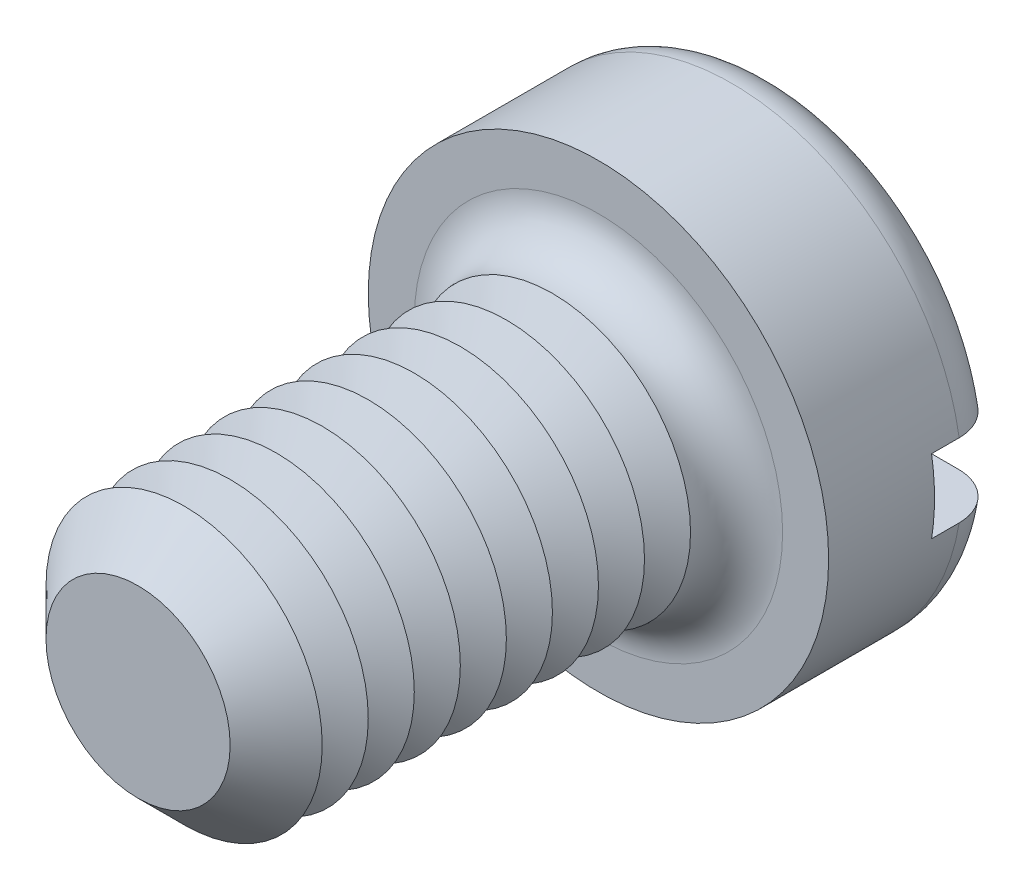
ISO-10303-21;
HEADER;
FILE_DESCRIPTION(('STEP AP214'),'2;1');
FILE_NAME('part.step','',(''),(''),'','','');
FILE_SCHEMA(('AUTOMOTIVE_DESIGN { 1 0 10303 214 1 1 1 1 }'));
ENDSEC;
DATA;
#1=APPLICATION_CONTEXT('core data for automotive mechanical design processes');
#2=APPLICATION_PROTOCOL_DEFINITION('international standard','automotive_design',2000,#1);
#3=PRODUCT_CONTEXT('',#1,'mechanical');
#4=PRODUCT('Part','Part','',(#3));
#5=PRODUCT_RELATED_PRODUCT_CATEGORY('part','',(#4));
#6=PRODUCT_DEFINITION_FORMATION('','',#4);
#7=PRODUCT_DEFINITION_CONTEXT('part definition',#1,'design');
#8=PRODUCT_DEFINITION('design','',#6,#7);
#9=PRODUCT_DEFINITION_SHAPE('','',#8);
#10=(LENGTH_UNIT() NAMED_UNIT(*) SI_UNIT(.MILLI.,.METRE.));
#11=(NAMED_UNIT(*) PLANE_ANGLE_UNIT() SI_UNIT($,.RADIAN.));
#12=(NAMED_UNIT(*) SI_UNIT($,.STERADIAN.) SOLID_ANGLE_UNIT());
#13=UNCERTAINTY_MEASURE_WITH_UNIT(LENGTH_MEASURE(1.E-05),#10,'distance_accuracy_value','');
#14=(GEOMETRIC_REPRESENTATION_CONTEXT(3) GLOBAL_UNCERTAINTY_ASSIGNED_CONTEXT((#13)) GLOBAL_UNIT_ASSIGNED_CONTEXT((#10,
#11,#12)) REPRESENTATION_CONTEXT('',''));
#15=CARTESIAN_POINT('',(0.,0.,0.));
#16=DIRECTION('',(0.,0.,1.));
#17=DIRECTION('',(1.,0.,0.));
#18=AXIS2_PLACEMENT_3D('',#15,#16,#17);
#19=CARTESIAN_POINT('',(0.,0.,-3.9));
#20=DIRECTION('',(0.,0.,1.));
#21=DIRECTION('',(1.,0.,0.));
#22=AXIS2_PLACEMENT_3D('',#19,#20,#21);
#23=PLANE('',#22);
#24=CARTESIAN_POINT('',(0.,0.,-3.9));
#25=DIRECTION('',(0.,0.,1.));
#26=DIRECTION('',(1.,0.,0.));
#27=AXIS2_PLACEMENT_3D('',#24,#25,#26);
#28=CIRCLE('',#27,4.);
#29=CARTESIAN_POINT('',(-3.91918358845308,0.800000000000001,-3.9));
#30=VERTEX_POINT('',#29);
#31=CARTESIAN_POINT('',(3.91918358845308,0.8,-3.9));
#32=VERTEX_POINT('',#31);
#33=EDGE_CURVE('E116',#30,#32,#28,.F.);
#34=ORIENTED_EDGE('',*,*,#33,.T.);
#35=DIRECTION('',(1.,0.,0.));
#36=VECTOR('',#35,1.);
#37=CARTESIAN_POINT('',(-5.,0.800000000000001,-3.9));
#38=LINE('',#37,#36);
#39=EDGE_CURVE('E111',#30,#32,#38,.T.);
#40=ORIENTED_EDGE('',*,*,#39,.F.);
#41=EDGE_LOOP('',(#34,#40));
#42=FACE_BOUND('',#41,.T.);
#43=ADVANCED_FACE('F39',(#42),#23,.F.);
#44=CARTESIAN_POINT('',(0.,0.,-2.9));
#45=DIRECTION('',(0.,0.,1.));
#46=DIRECTION('',(1.,0.,0.));
#47=AXIS2_PLACEMENT_3D('',#44,#45,#46);
#48=TOROIDAL_SURFACE('',#47,4.,1.);
#49=CARTESIAN_POINT('',(-4.76648512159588,0.800000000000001,-3.45304061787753));
#50=CARTESIAN_POINT('',(-4.73486405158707,0.800000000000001,-3.50001565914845));
#51=CARTESIAN_POINT('',(-4.69920787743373,0.800000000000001,-3.54432871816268));
#52=CARTESIAN_POINT('',(-4.62090302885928,0.800000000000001,-3.62634638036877));
#53=CARTESIAN_POINT('',(-4.57824494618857,0.800000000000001,-3.66404194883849));
#54=CARTESIAN_POINT('',(-4.48726975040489,0.800000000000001,-3.73172278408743));
#55=CARTESIAN_POINT('',(-4.43895902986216,0.800000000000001,-3.76171664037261));
#56=CARTESIAN_POINT('',(-4.33804923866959,0.800000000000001,-3.81326437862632));
#57=CARTESIAN_POINT('',(-4.2854512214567,0.800000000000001,-3.8348203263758));
#58=CARTESIAN_POINT('',(-4.17679895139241,0.800000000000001,-3.86918431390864));
#59=CARTESIAN_POINT('',(-4.12071163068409,0.800000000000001,-3.88188775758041));
#60=CARTESIAN_POINT('',(-4.00720729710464,0.800000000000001,-3.89785932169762));
#61=CARTESIAN_POINT('',(-3.94979011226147,0.800000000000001,-3.9011262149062));
#62=CARTESIAN_POINT('',(-3.83429042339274,0.800000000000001,-3.89816676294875));
#63=CARTESIAN_POINT('',(-3.77621176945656,0.800000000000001,-3.89178937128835));
#64=CARTESIAN_POINT('',(-3.66191938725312,0.800000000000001,-3.8694726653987));
#65=CARTESIAN_POINT('',(-3.60570580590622,0.800000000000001,-3.85353259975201));
#66=CARTESIAN_POINT('',(-3.49618749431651,0.800000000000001,-3.81233202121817));
#67=CARTESIAN_POINT('',(-3.44291561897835,0.800000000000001,-3.78698406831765));
#68=CARTESIAN_POINT('',(-3.34140774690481,0.800000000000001,-3.72766098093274));
#69=CARTESIAN_POINT('',(-3.29317182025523,0.800000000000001,-3.69368572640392));
#70=CARTESIAN_POINT('',(-3.20343355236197,0.800000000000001,-3.6182054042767));
#71=CARTESIAN_POINT('',(-3.16189680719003,0.800000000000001,-3.57674128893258));
#72=CARTESIAN_POINT('',(-3.08658236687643,0.800000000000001,-3.48727547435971));
#73=CARTESIAN_POINT('',(-3.05280364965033,0.800000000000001,-3.43927463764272));
#74=CARTESIAN_POINT('',(-2.99489532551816,0.800000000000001,-3.33932895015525));
#75=CARTESIAN_POINT('',(-2.97055012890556,0.800000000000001,-3.28750911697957));
#76=CARTESIAN_POINT('',(-2.93124252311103,0.800000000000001,-3.18042600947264));
#77=CARTESIAN_POINT('',(-2.91627793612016,0.800000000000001,-3.12516353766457));
#78=CARTESIAN_POINT('',(-2.89663075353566,0.800000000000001,-3.01470560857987));
#79=CARTESIAN_POINT('',(-2.89162828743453,0.800000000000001,-2.95956691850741));
#80=CARTESIAN_POINT('',(-2.89112479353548,0.800000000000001,-2.84924961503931));
#81=CARTESIAN_POINT('',(-2.89562264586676,0.800000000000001,-2.79407100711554));
#82=CARTESIAN_POINT('',(-2.91379565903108,0.800000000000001,-2.6861912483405));
#83=CARTESIAN_POINT('',(-2.92731815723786,0.800000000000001,-2.63346424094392));
#84=CARTESIAN_POINT('',(-2.96290888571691,0.800000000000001,-2.53098203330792));
#85=CARTESIAN_POINT('',(-2.98497757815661,0.800000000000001,-2.48122699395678));
#86=CARTESIAN_POINT('',(-3.03728055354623,0.800000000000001,-2.38535286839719));
#87=CARTESIAN_POINT('',(-3.06761989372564,0.800000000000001,-2.33929117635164));
#88=CARTESIAN_POINT('',(-3.13537950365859,0.800000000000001,-2.2527125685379));
#89=CARTESIAN_POINT('',(-3.17280082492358,0.800000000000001,-2.21219647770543));
#90=CARTESIAN_POINT('',(-3.2549164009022,0.800000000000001,-2.13651195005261));
#91=CARTESIAN_POINT('',(-3.29980186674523,0.800000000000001,-2.10155095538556));
#92=CARTESIAN_POINT('',(-3.39467666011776,0.800000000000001,-2.03942270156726));
#93=CARTESIAN_POINT('',(-3.44466673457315,0.800000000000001,-2.01225658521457));
#94=CARTESIAN_POINT('',(-3.5497933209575,0.800000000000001,-1.96576935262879));
#95=CARTESIAN_POINT('',(-3.60503228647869,0.800000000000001,-1.94667963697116));
#96=CARTESIAN_POINT('',(-3.71791613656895,0.800000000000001,-1.91794308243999));
#97=CARTESIAN_POINT('',(-3.77556119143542,0.800000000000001,-1.90829691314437));
#98=CARTESIAN_POINT('',(-3.89221522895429,0.800000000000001,-1.89869331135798));
#99=CARTESIAN_POINT('',(-3.9512319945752,0.800000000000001,-1.89882985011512));
#100=CARTESIAN_POINT('',(-4.06839541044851,0.800000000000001,-1.90907818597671));
#101=CARTESIAN_POINT('',(-4.12654207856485,0.800000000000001,-1.91918977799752));
#102=CARTESIAN_POINT('',(-4.23988103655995,0.800000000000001,-1.9490667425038));
#103=CARTESIAN_POINT('',(-4.29509069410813,0.800000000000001,-1.96876615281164));
#104=CARTESIAN_POINT('',(-4.40134194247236,0.800000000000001,-2.01729572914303));
#105=CARTESIAN_POINT('',(-4.45238383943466,0.800000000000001,-2.04612522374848));
#106=CARTESIAN_POINT('',(-4.54801343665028,0.800000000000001,-2.1116316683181));
#107=CARTESIAN_POINT('',(-4.59268768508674,0.800000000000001,-2.14818225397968));
#108=CARTESIAN_POINT('',(-4.67513924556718,0.800000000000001,-2.22837632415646));
#109=CARTESIAN_POINT('',(-4.71291715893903,0.800000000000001,-2.27201918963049));
#110=CARTESIAN_POINT('',(-4.77986554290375,0.800000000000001,-2.36439990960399));
#111=CARTESIAN_POINT('',(-4.80916462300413,0.800000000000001,-2.41304457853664));
#112=CARTESIAN_POINT('',(-4.85906149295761,0.800000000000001,-2.51460659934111));
#113=CARTESIAN_POINT('',(-4.8796602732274,0.800000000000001,-2.56752346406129));
#114=CARTESIAN_POINT('',(-4.9113264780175,0.800000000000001,-2.67542592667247));
#115=CARTESIAN_POINT('',(-4.92250819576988,0.800000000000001,-2.73037800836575));
#116=CARTESIAN_POINT('',(-4.93542682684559,0.800000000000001,-2.84139649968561));
#117=CARTESIAN_POINT('',(-4.93716171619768,0.800000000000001,-2.89746314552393));
#118=CARTESIAN_POINT('',(-4.93114851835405,0.800000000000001,-3.00876455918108));
#119=CARTESIAN_POINT('',(-4.92345325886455,0.800000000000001,-3.0640022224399));
#120=CARTESIAN_POINT('',(-4.8989032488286,0.800000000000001,-3.17235240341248));
#121=CARTESIAN_POINT('',(-4.88205998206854,0.800000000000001,-3.22546749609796));
#122=CARTESIAN_POINT('',(-4.84819200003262,0.800000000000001,-3.30764066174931));
#123=CARTESIAN_POINT('',(-4.83390853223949,0.800000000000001,-3.33785845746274));
#124=CARTESIAN_POINT('',(-4.80237957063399,0.800000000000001,-3.39670633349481));
#125=CARTESIAN_POINT('',(-4.78513409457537,0.800000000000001,-3.42533642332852));
#126=CARTESIAN_POINT('',(-4.76648512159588,0.800000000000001,-3.45304061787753));
#127=B_SPLINE_CURVE_WITH_KNOTS('',3,(#49,#50,#51,#52,#53,#54,#55,#56,#57,#58,#59,#60,#61,#62,
#63,#64,#65,#66,#67,#68,#69,#70,#71,#72,#73,#74,#75,#76,#77,#78,#79,#80,#81,#82,#83,#84,#85,#86,
#87,#88,#89,#90,#91,#92,#93,#94,#95,#96,#97,#98,#99,#100,#101,#102,#103,#104,#105,#106,#107,
#108,#109,#110,#111,#112,#113,#114,#115,#116,#117,#118,#119,#120,#121,#122,#123,#124,#125,#126),
.UNSPECIFIED.,.T.,.F.,(4,2,2,2,2,2,2,2,2,2,2,2,2,2,2,2,2,2,2,2,2,2,2,2,2,2,2,2,2,2,2,2,2,2,2,2,
2,2,4),(0.,0.169755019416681,0.339740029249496,0.509534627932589,0.67928763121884,
0.851013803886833,1.02276230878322,1.19722869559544,1.37170879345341,1.54785292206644,
1.72399950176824,1.89921049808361,2.07439839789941,2.24530597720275,2.41617386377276,
2.58146078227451,2.74672821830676,2.90926852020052,3.0718176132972,3.2365363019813,
3.40127946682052,3.57118676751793,3.74111896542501,3.91563534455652,4.09016409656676,
4.26636956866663,4.4425714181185,4.61757781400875,4.79257134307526,4.96489650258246,
5.13720662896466,5.30674670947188,5.47626748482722,5.64369988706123,5.81116816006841,
5.97770254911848,6.14402836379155,6.24414438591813,6.34425980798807),.UNSPECIFIED.);
#128=CARTESIAN_POINT('',(-4.93558507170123,0.800000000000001,-2.9));
#129=VERTEX_POINT('',#128);
#130=EDGE_CURVE('E242',#129,#30,#127,.T.);
#131=ORIENTED_EDGE('',*,*,#130,.F.);
#132=CARTESIAN_POINT('',(0.,0.,-2.9));
#133=DIRECTION('',(0.,0.,1.));
#134=DIRECTION('',(1.,0.,0.));
#135=AXIS2_PLACEMENT_3D('',#132,#133,#134);
#136=CIRCLE('',#135,5.);
#137=CARTESIAN_POINT('',(4.93558507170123,0.8,-2.9));
#138=VERTEX_POINT('',#137);
#139=EDGE_CURVE('E125',#138,#129,#136,.T.);
#140=ORIENTED_EDGE('',*,*,#139,.F.);
#141=CARTESIAN_POINT('',(2.98553785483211,0.8,-3.31649797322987));
#142=CARTESIAN_POINT('',(3.00991125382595,0.8,-3.36788093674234));
#143=CARTESIAN_POINT('',(3.03875556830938,0.8,-3.41719756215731));
#144=CARTESIAN_POINT('',(3.1043993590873,0.8,-3.51028676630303));
#145=CARTESIAN_POINT('',(3.1412115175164,0.8,-3.55405032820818));
#146=CARTESIAN_POINT('',(3.22153641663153,0.8,-3.63476402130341));
#147=CARTESIAN_POINT('',(3.26503706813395,0.8,-3.67172618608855));
#148=CARTESIAN_POINT('',(3.35749627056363,0.8,-3.73799476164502));
#149=CARTESIAN_POINT('',(3.4064533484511,0.8,-3.76730323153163));
#150=CARTESIAN_POINT('',(3.5095773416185,0.8,-3.81809642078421));
#151=CARTESIAN_POINT('',(3.56383317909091,0.8,-3.83940072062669));
#152=CARTESIAN_POINT('',(3.67513017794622,0.8,-3.87272481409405));
#153=CARTESIAN_POINT('',(3.7321717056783,0.8,-3.88474338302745));
#154=CARTESIAN_POINT('',(3.84815688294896,0.8,-3.89923413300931));
#155=CARTESIAN_POINT('',(3.90711516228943,0.8,-3.9015896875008));
#156=CARTESIAN_POINT('',(4.02458610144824,0.8,-3.89631753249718));
#157=CARTESIAN_POINT('',(4.08309876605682,0.8,-3.8886899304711));
#158=CARTESIAN_POINT('',(4.19768646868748,0.8,-3.86366584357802));
#159=CARTESIAN_POINT('',(4.25377243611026,0.8,-3.84631948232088));
#160=CARTESIAN_POINT('',(4.3621676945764,0.8,-3.80231797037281));
#161=CARTESIAN_POINT('',(4.41447726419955,0.8,-3.77566350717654));
#162=CARTESIAN_POINT('',(4.51300872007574,0.8,-3.71421163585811));
#163=CARTESIAN_POINT('',(4.5593085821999,0.8,-3.67953927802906));
#164=CARTESIAN_POINT('',(4.64530675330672,0.8,-3.60279495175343));
#165=CARTESIAN_POINT('',(4.68500564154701,0.8,-3.56072363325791));
#166=CARTESIAN_POINT('',(4.75599202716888,0.8,-3.47111750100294));
#167=CARTESIAN_POINT('',(4.7874061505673,0.8,-3.42368298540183));
#168=CARTESIAN_POINT('',(4.84170328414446,0.8,-3.32415927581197));
#169=CARTESIAN_POINT('',(4.86458695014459,0.8,-3.2720704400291));
#170=CARTESIAN_POINT('',(4.90088120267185,0.8,-3.16544016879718));
#171=CARTESIAN_POINT('',(4.91440984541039,0.8,-3.11093889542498));
#172=CARTESIAN_POINT('',(4.93205429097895,0.8,-3.00043391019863));
#173=CARTESIAN_POINT('',(4.93617053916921,0.8,-2.9444302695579));
#174=CARTESIAN_POINT('',(4.93486973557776,0.8,-2.83292218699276));
#175=CARTESIAN_POINT('',(4.92951827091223,0.8,-2.77741696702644));
#176=CARTESIAN_POINT('',(4.90957104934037,0.8,-2.66809456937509));
#177=CARTESIAN_POINT('',(4.89497541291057,0.8,-2.61427736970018));
#178=CARTESIAN_POINT('',(4.85697876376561,0.8,-2.50985095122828));
#179=CARTESIAN_POINT('',(4.83357805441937,0.8,-2.45924162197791));
#180=CARTESIAN_POINT('',(4.77866660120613,0.8,-2.36263484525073));
#181=CARTESIAN_POINT('',(4.74715567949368,0.8,-2.31663749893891));
#182=CARTESIAN_POINT('',(4.67670791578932,0.8,-2.23021464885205));
#183=CARTESIAN_POINT('',(4.6377224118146,0.8,-2.1898288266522));
#184=CARTESIAN_POINT('',(4.55359880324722,0.8,-2.11607828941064));
#185=CARTESIAN_POINT('',(4.50846036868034,0.8,-2.08271395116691));
#186=CARTESIAN_POINT('',(4.41271544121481,0.8,-2.02349513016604));
#187=CARTESIAN_POINT('',(4.36204749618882,0.8,-1.99774003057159));
#188=CARTESIAN_POINT('',(4.257155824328,0.8,-1.95495040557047));
#189=CARTESIAN_POINT('',(4.20293181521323,0.8,-1.93791657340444));
#190=CARTESIAN_POINT('',(4.09154156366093,0.8,-1.91276335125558));
#191=CARTESIAN_POINT('',(4.03434212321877,0.8,-1.90479098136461));
#192=CARTESIAN_POINT('',(3.91941228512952,0.8,-1.89840884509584));
#193=CARTESIAN_POINT('',(3.8616818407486,0.8,-1.89999992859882));
#194=CARTESIAN_POINT('',(3.7464111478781,0.8,-1.91275144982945));
#195=CARTESIAN_POINT('',(3.6888866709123,0.8,-1.92405471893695));
#196=CARTESIAN_POINT('',(3.57652290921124,0.8,-1.95609086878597));
#197=CARTESIAN_POINT('',(3.52168382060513,0.8,-1.97682443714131));
#198=CARTESIAN_POINT('',(3.41589179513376,0.8,-2.02733294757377));
#199=CARTESIAN_POINT('',(3.36496676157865,0.8,-2.05716640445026));
#200=CARTESIAN_POINT('',(3.26890903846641,0.8,-2.12504079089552));
#201=CARTESIAN_POINT('',(3.22377627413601,0.8,-2.16308161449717));
#202=CARTESIAN_POINT('',(3.141135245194,0.8,-2.24593284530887));
#203=CARTESIAN_POINT('',(3.1035541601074,0.8,-2.29067053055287));
#204=CARTESIAN_POINT('',(3.03669700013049,0.8,-2.38597317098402));
#205=CARTESIAN_POINT('',(3.00741914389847,0.8,-2.43653687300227));
#206=CARTESIAN_POINT('',(2.95891799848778,0.8,-2.54052959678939));
#207=CARTESIAN_POINT('',(2.93943249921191,0.8,-2.59383627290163));
#208=CARTESIAN_POINT('',(2.9100081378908,0.8,-2.70303736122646));
#209=CARTESIAN_POINT('',(2.90006970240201,0.8,-2.75893188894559));
#210=CARTESIAN_POINT('',(2.89027863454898,0.8,-2.86986958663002));
#211=CARTESIAN_POINT('',(2.89012791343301,0.8,-2.92488680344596));
#212=CARTESIAN_POINT('',(2.89917145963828,0.8,-3.03409648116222));
#213=CARTESIAN_POINT('',(2.90835313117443,0.8,-3.08828995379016));
#214=CARTESIAN_POINT('',(2.92977618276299,0.8,-3.17141652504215));
#215=CARTESIAN_POINT('',(2.93899011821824,0.8,-3.20116372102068));
#216=CARTESIAN_POINT('',(2.96020249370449,0.8,-3.25964614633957));
#217=CARTESIAN_POINT('',(2.97220082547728,0.8,-3.28838141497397));
#218=CARTESIAN_POINT('',(2.98553785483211,0.8,-3.31649797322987));
#219=B_SPLINE_CURVE_WITH_KNOTS('',3,(#141,#142,#143,#144,#145,#146,#147,#148,#149,#150,#151,
#152,#153,#154,#155,#156,#157,#158,#159,#160,#161,#162,#163,#164,#165,#166,#167,#168,#169,#170,
#171,#172,#173,#174,#175,#176,#177,#178,#179,#180,#181,#182,#183,#184,#185,#186,#187,#188,#189,
#190,#191,#192,#193,#194,#195,#196,#197,#198,#199,#200,#201,#202,#203,#204,#205,#206,#207,#208,
#209,#210,#211,#212,#213,#214,#215,#216,#217,#218),.UNSPECIFIED.,.T.,.F.,(4,2,2,2,2,2,2,2,2,2,2,
2,2,2,2,2,2,2,2,2,2,2,2,2,2,2,2,2,2,2,2,2,2,2,2,2,2,2,4),(0.,0.170493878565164,
0.341261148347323,0.511723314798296,0.682139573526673,0.856194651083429,1.03027268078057,
1.20644565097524,1.38261672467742,1.55788746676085,1.73314526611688,1.90583484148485,
2.07850925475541,2.24836742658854,2.41821253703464,2.58587311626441,2.75352576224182,
2.92002154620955,3.08651516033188,3.25300303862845,3.41949456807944,3.58710926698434,
3.75473295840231,3.92445790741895,4.09419634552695,4.26665110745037,4.43912119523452,
4.61417197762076,4.78923552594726,4.96544940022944,5.1416609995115,5.31608191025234,
5.49046537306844,5.65989063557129,5.82932346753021,5.99359365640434,6.157642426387,
6.250939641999,6.34423323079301),.UNSPECIFIED.);
#220=EDGE_CURVE('E244',#32,#138,#219,.T.);
#221=ORIENTED_EDGE('',*,*,#220,.F.);
#222=ORIENTED_EDGE('',*,*,#33,.F.);
#223=EDGE_LOOP('',(#131,#140,#221,#222));
#224=FACE_BOUND('',#223,.T.);
#225=ADVANCED_FACE('F226',(#224),#48,.T.);
#226=CARTESIAN_POINT('',(0.,0.,-3.9));
#227=DIRECTION('',(0.,0.,1.));
#228=DIRECTION('',(1.,0.,0.));
#229=AXIS2_PLACEMENT_3D('',#226,#227,#228);
#230=CYLINDRICAL_SURFACE('',#229,5.);
#231=DIRECTION('',(0.,0.,1.));
#232=VECTOR('',#231,1.);
#233=CARTESIAN_POINT('',(4.93558507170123,0.8,-3.9));
#234=LINE('',#233,#232);
#235=CARTESIAN_POINT('',(4.93558507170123,0.8,-2.3));
#236=VERTEX_POINT('',#235);
#237=EDGE_CURVE('E260',#138,#236,#234,.T.);
#238=ORIENTED_EDGE('',*,*,#237,.F.);
#239=ORIENTED_EDGE('',*,*,#139,.T.);
#240=DIRECTION('',(0.,0.,1.));
#241=VECTOR('',#240,1.);
#242=CARTESIAN_POINT('',(-4.93558507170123,0.800000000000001,-3.9));
#243=LINE('',#242,#241);
#244=CARTESIAN_POINT('',(-4.93558507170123,0.800000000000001,-2.3));
#245=VERTEX_POINT('',#244);
#246=EDGE_CURVE('E63',#245,#129,#243,.F.);
#247=ORIENTED_EDGE('',*,*,#246,.F.);
#248=CARTESIAN_POINT('',(0.,0.,-2.3));
#249=DIRECTION('',(0.,0.,-1.));
#250=DIRECTION('',(-1.,0.,0.));
#251=AXIS2_PLACEMENT_3D('',#248,#249,#250);
#252=CIRCLE('',#251,5.);
#253=CARTESIAN_POINT('',(-4.93558507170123,-0.799999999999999,-2.3));
#254=VERTEX_POINT('',#253);
#255=EDGE_CURVE('E43',#245,#254,#252,.F.);
#256=ORIENTED_EDGE('',*,*,#255,.T.);
#257=DIRECTION('',(0.,0.,1.));
#258=VECTOR('',#257,1.);
#259=CARTESIAN_POINT('',(-4.93558507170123,-0.799999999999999,-3.9));
#260=LINE('',#259,#258);
#261=CARTESIAN_POINT('',(-4.93558507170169,-0.799999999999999,-2.89999999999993));
#262=VERTEX_POINT('',#261);
#263=EDGE_CURVE('E257',#262,#254,#260,.T.);
#264=ORIENTED_EDGE('',*,*,#263,.F.);
#265=CARTESIAN_POINT('',(4.93558507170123,-0.8,-2.9));
#266=VERTEX_POINT('',#265);
#267=EDGE_CURVE('E127',#262,#266,#136,.T.);
#268=ORIENTED_EDGE('',*,*,#267,.T.);
#269=DIRECTION('',(0.,0.,1.));
#270=VECTOR('',#269,1.);
#271=CARTESIAN_POINT('',(4.93558507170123,-0.8,-3.9));
#272=LINE('',#271,#270);
#273=CARTESIAN_POINT('',(4.93558507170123,-0.8,-2.3));
#274=VERTEX_POINT('',#273);
#275=EDGE_CURVE('E55',#274,#266,#272,.F.);
#276=ORIENTED_EDGE('',*,*,#275,.F.);
#277=EDGE_CURVE('E11',#274,#236,#252,.F.);
#278=ORIENTED_EDGE('',*,*,#277,.T.);
#279=EDGE_LOOP('',(#238,#239,#247,#256,#264,#268,#276,#278));
#280=FACE_BOUND('',#279,.T.);
#281=CARTESIAN_POINT('',(0.,0.,0.));
#282=DIRECTION('',(0.,0.,1.));
#283=DIRECTION('',(1.,0.,0.));
#284=AXIS2_PLACEMENT_3D('',#281,#282,#283);
#285=CIRCLE('',#284,5.);
#286=CARTESIAN_POINT('',(5.,0.,0.));
#287=VERTEX_POINT('',#286);
#288=EDGE_CURVE('E262',#287,#287,#285,.T.);
#289=ORIENTED_EDGE('',*,*,#288,.F.);
#290=EDGE_LOOP('',(#289));
#291=FACE_BOUND('',#290,.T.);
#292=ADVANCED_FACE('F222',(#280,#291),#230,.T.);
#293=CARTESIAN_POINT('',(3.91918358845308,-0.8,-3.9));
#294=VERTEX_POINT('',#293);
#295=CARTESIAN_POINT('',(-3.91918358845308,-0.799999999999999,-3.9));
#296=VERTEX_POINT('',#295);
#297=EDGE_CURVE('E109',#294,#296,#28,.F.);
#298=ORIENTED_EDGE('',*,*,#297,.T.);
#299=DIRECTION('',(-1.,0.,0.));
#300=VECTOR('',#299,1.);
#301=CARTESIAN_POINT('',(-5.,-0.799999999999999,-3.9));
#302=LINE('',#301,#300);
#303=EDGE_CURVE('E96',#294,#296,#302,.T.);
#304=ORIENTED_EDGE('',*,*,#303,.F.);
#305=EDGE_LOOP('',(#298,#304));
#306=FACE_BOUND('',#305,.T.);
#307=ADVANCED_FACE('F108',(#306),#23,.F.);
#308=CARTESIAN_POINT('',(0.,0.,0.));
#309=DIRECTION('',(0.,0.,1.));
#310=DIRECTION('',(1.,0.,0.));
#311=AXIS2_PLACEMENT_3D('',#308,#309,#310);
#312=PLANE('',#311);
#313=CARTESIAN_POINT('',(0.,0.,0.));
#314=DIRECTION('',(0.,0.,1.));
#315=DIRECTION('',(1.,0.,0.));
#316=AXIS2_PLACEMENT_3D('',#313,#314,#315);
#317=CIRCLE('',#316,4.);
#318=CARTESIAN_POINT('',(4.,0.,0.));
#319=VERTEX_POINT('',#318);
#320=EDGE_CURVE('E115',#319,#319,#317,.F.);
#321=ORIENTED_EDGE('',*,*,#320,.T.);
#322=EDGE_LOOP('',(#321));
#323=FACE_BOUND('',#322,.T.);
#324=ORIENTED_EDGE('',*,*,#288,.T.);
#325=EDGE_LOOP('',(#324));
#326=FACE_BOUND('',#325,.T.);
#327=ADVANCED_FACE('F221',(#323,#326),#312,.T.);
#328=CARTESIAN_POINT('',(-4.76648512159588,-0.799999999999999,-3.45304061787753));
#329=CARTESIAN_POINT('',(-4.7975694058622,-0.799999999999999,-3.40685392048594));
#330=CARTESIAN_POINT('',(-4.82479903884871,-0.799999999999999,-3.35802740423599));
#331=CARTESIAN_POINT('',(-4.87070632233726,-0.799999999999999,-3.25646127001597));
#332=CARTESIAN_POINT('',(-4.8893747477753,-0.799999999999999,-3.20371750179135));
#333=CARTESIAN_POINT('',(-4.91756720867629,-0.799999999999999,-3.09584501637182));
#334=CARTESIAN_POINT('',(-4.92709302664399,-0.799999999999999,-3.04071676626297));
#335=CARTESIAN_POINT('',(-4.93671217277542,-0.799999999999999,-2.92965669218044));
#336=CARTESIAN_POINT('',(-4.93680767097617,-0.799999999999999,-2.87372505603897));
#337=CARTESIAN_POINT('',(-4.92758675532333,-0.799999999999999,-2.76284675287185));
#338=CARTESIAN_POINT('',(-4.91830421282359,-0.799999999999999,-2.70789726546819));
#339=CARTESIAN_POINT('',(-4.89065741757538,-0.799999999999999,-2.60033228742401));
#340=CARTESIAN_POINT('',(-4.87229291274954,-0.799999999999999,-2.54771686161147));
#341=CARTESIAN_POINT('',(-4.82699855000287,-0.799999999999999,-2.44622441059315));
#342=CARTESIAN_POINT('',(-4.80005659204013,-0.799999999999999,-2.39735278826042));
#343=CARTESIAN_POINT('',(-4.73841244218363,-0.799999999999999,-2.30477947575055));
#344=CARTESIAN_POINT('',(-4.70371003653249,-0.799999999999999,-2.26107792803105));
#345=CARTESIAN_POINT('',(-4.62724516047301,-0.799999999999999,-2.17969334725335));
#346=CARTESIAN_POINT('',(-4.58542787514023,-0.799999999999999,-2.14206183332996));
#347=CARTESIAN_POINT('',(-4.49614171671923,-0.799999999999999,-2.07424284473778));
#348=CARTESIAN_POINT('',(-4.44867251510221,-0.799999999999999,-2.04405580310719));
#349=CARTESIAN_POINT('',(-4.34875035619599,-0.799999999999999,-1.99153688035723));
#350=CARTESIAN_POINT('',(-4.29623870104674,-0.799999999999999,-1.96931670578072));
#351=CARTESIAN_POINT('',(-4.18826905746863,-0.799999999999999,-1.93384994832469));
#352=CARTESIAN_POINT('',(-4.1328108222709,-0.799999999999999,-1.92060411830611));
#353=CARTESIAN_POINT('',(-4.01956054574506,-0.799999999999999,-1.90323798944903));
#354=CARTESIAN_POINT('',(-3.96174522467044,-0.799999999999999,-1.89926947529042));
#355=CARTESIAN_POINT('',(-3.84625419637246,-0.799999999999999,-1.90095183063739));
#356=CARTESIAN_POINT('',(-3.78857850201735,-0.799999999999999,-1.90660355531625));
#357=CARTESIAN_POINT('',(-3.67415602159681,-0.799999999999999,-1.92748272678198));
#358=CARTESIAN_POINT('',(-3.61743328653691,-0.799999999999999,-1.94284216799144));
#359=CARTESIAN_POINT('',(-3.50734962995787,-0.799999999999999,-1.9828275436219));
#360=CARTESIAN_POINT('',(-3.4539889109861,-0.799999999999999,-2.00745403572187));
#361=CARTESIAN_POINT('',(-3.35197118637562,-0.799999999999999,-2.06542964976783));
#362=CARTESIAN_POINT('',(-3.30333217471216,-0.799999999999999,-2.0988104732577));
#363=CARTESIAN_POINT('',(-3.21244692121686,-0.799999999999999,-2.17337326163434));
#364=CARTESIAN_POINT('',(-3.17020039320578,-0.799999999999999,-2.21455487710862));
#365=CARTESIAN_POINT('',(-3.0940098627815,-0.799999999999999,-2.30296695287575));
#366=CARTESIAN_POINT('',(-3.05995540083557,-0.799999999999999,-2.35010211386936));
#367=CARTESIAN_POINT('',(-3.00053815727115,-0.799999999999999,-2.4495670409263));
#368=CARTESIAN_POINT('',(-2.97517362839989,-0.799999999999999,-2.50189576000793));
#369=CARTESIAN_POINT('',(-2.93470320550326,-0.799999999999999,-2.60853979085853));
#370=CARTESIAN_POINT('',(-2.91930557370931,-0.799999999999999,-2.66274437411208));
#371=CARTESIAN_POINT('',(-2.89812734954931,-0.799999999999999,-2.77299836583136));
#372=CARTESIAN_POINT('',(-2.89234481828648,-0.799999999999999,-2.82904740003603));
#373=CARTESIAN_POINT('',(-2.89064073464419,-0.799999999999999,-2.93970612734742));
#374=CARTESIAN_POINT('',(-2.89444549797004,-0.799999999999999,-2.99431180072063));
#375=CARTESIAN_POINT('',(-2.9112006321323,-0.799999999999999,-3.10209766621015));
#376=CARTESIAN_POINT('',(-2.9241507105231,-0.799999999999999,-3.1552779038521));
#377=CARTESIAN_POINT('',(-2.95868580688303,-0.799999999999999,-3.25858631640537));
#378=CARTESIAN_POINT('',(-2.98024709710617,-0.799999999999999,-3.30872244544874));
#379=CARTESIAN_POINT('',(-3.03128544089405,-0.799999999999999,-3.40478519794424));
#380=CARTESIAN_POINT('',(-3.06076335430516,-0.799999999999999,-3.45071136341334));
#381=CARTESIAN_POINT('',(-3.12753448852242,-0.799999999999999,-3.53826932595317));
#382=CARTESIAN_POINT('',(-3.16500083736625,-0.799999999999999,-3.57976901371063));
#383=CARTESIAN_POINT('',(-3.24617503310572,-0.799999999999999,-3.65613204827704));
#384=CARTESIAN_POINT('',(-3.28988388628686,-0.799999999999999,-3.69099432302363));
#385=CARTESIAN_POINT('',(-3.38380639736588,-0.799999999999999,-3.75424083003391));
#386=CARTESIAN_POINT('',(-3.43418287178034,-0.799999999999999,-3.78238342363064));
#387=CARTESIAN_POINT('',(-3.53887888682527,-0.799999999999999,-3.83000231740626));
#388=CARTESIAN_POINT('',(-3.59319889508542,-0.799999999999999,-3.84947758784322));
#389=CARTESIAN_POINT('',(-3.70539237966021,-0.799999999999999,-3.87954336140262));
#390=CARTESIAN_POINT('',(-3.76331464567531,-0.799999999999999,-3.88995217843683));
#391=CARTESIAN_POINT('',(-3.88008461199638,-0.799999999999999,-3.9009132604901));
#392=CARTESIAN_POINT('',(-3.93893230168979,-0.799999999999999,-3.9014656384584));
#393=CARTESIAN_POINT('',(-4.05594892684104,-0.799999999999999,-3.89264187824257));
#394=CARTESIAN_POINT('',(-4.11411702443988,-0.799999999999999,-3.88325457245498));
#395=CARTESIAN_POINT('',(-4.22802928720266,-0.799999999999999,-3.85472582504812));
#396=CARTESIAN_POINT('',(-4.28377297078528,-0.799999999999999,-3.83558245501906));
#397=CARTESIAN_POINT('',(-4.39054463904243,-0.799999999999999,-3.78829842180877));
#398=CARTESIAN_POINT('',(-4.44161887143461,-0.799999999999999,-3.76026208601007));
#399=CARTESIAN_POINT('',(-4.53818016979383,-0.799999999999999,-3.69589278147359));
#400=CARTESIAN_POINT('',(-4.58367442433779,-0.799999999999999,-3.65957066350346));
#401=CARTESIAN_POINT('',(-4.65208830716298,-0.799999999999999,-3.59453310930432));
#402=CARTESIAN_POINT('',(-4.67711825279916,-0.799999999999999,-3.56800018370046));
#403=CARTESIAN_POINT('',(-4.72414423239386,-0.799999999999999,-3.51236863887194));
#404=CARTESIAN_POINT('',(-4.74614029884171,-0.799999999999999,-3.48327004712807));
#405=CARTESIAN_POINT('',(-4.76648512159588,-0.799999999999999,-3.45304061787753));
#406=B_SPLINE_CURVE_WITH_KNOTS('',3,(#328,#329,#330,#331,#332,#333,#334,#335,#336,#337,#338,
#339,#340,#341,#342,#343,#344,#345,#346,#347,#348,#349,#350,#351,#352,#353,#354,#355,#356,#357,
#358,#359,#360,#361,#362,#363,#364,#365,#366,#367,#368,#369,#370,#371,#372,#373,#374,#375,#376,
#377,#378,#379,#380,#381,#382,#383,#384,#385,#386,#387,#388,#389,#390,#391,#392,#393,#394,#395,
#396,#397,#398,#399,#400,#401,#402,#403,#404,#405),.UNSPECIFIED.,.T.,.F.,(4,2,2,2,2,2,2,2,2,2,2,
2,2,2,2,2,2,2,2,2,2,2,2,2,2,2,2,2,2,2,2,2,2,2,2,2,2,2,4),(0.,0.166886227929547,
0.333951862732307,0.500984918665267,0.667979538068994,0.834373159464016,1.00077139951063,
1.16740542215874,1.33404403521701,1.50202999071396,1.67002571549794,1.84029248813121,
2.01057354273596,2.18362161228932,2.35668506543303,2.53215380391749,2.70763310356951,
2.88375684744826,3.05987270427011,3.23346085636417,3.40701408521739,3.57522519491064,
3.74340238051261,3.90683338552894,4.0702591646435,4.23323770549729,4.39623395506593,
4.56320691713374,4.7302068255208,4.90252468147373,5.07486300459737,5.25058028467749,
5.42629555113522,5.60220844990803,5.77815613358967,5.95211162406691,6.12584060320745,
6.23506966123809,6.34429754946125),.UNSPECIFIED.);
#407=EDGE_CURVE('E103',#296,#262,#406,.T.);
#408=ORIENTED_EDGE('',*,*,#407,.F.);
#409=ORIENTED_EDGE('',*,*,#297,.F.);
#410=CARTESIAN_POINT('',(2.98553785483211,-0.8,-3.31649797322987));
#411=CARTESIAN_POINT('',(2.96216773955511,-0.8,-3.26721849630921));
#412=CARTESIAN_POINT('',(2.94287503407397,-0.8,-3.21596872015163));
#413=CARTESIAN_POINT('',(2.91313258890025,-0.8,-3.11092723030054));
#414=CARTESIAN_POINT('',(2.9026902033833,-0.8,-3.0571334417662));
#415=CARTESIAN_POINT('',(2.89104377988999,-0.8,-2.94853922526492));
#416=CARTESIAN_POINT('',(2.88984130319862,-0.8,-2.89373862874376));
#417=CARTESIAN_POINT('',(2.89672585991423,-0.8,-2.78473646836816));
#418=CARTESIAN_POINT('',(2.90481120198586,-0.8,-2.73053479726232));
#419=CARTESIAN_POINT('',(2.92989134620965,-0.8,-2.62460092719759));
#420=CARTESIAN_POINT('',(2.94682969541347,-0.8,-2.57285532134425));
#421=CARTESIAN_POINT('',(2.9889990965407,-0.8,-2.47286425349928));
#422=CARTESIAN_POINT('',(3.01423103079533,-0.8,-2.42461916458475));
#423=CARTESIAN_POINT('',(3.07271536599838,-0.8,-2.33201565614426));
#424=CARTESIAN_POINT('',(3.10610710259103,-0.8,-2.28774532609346));
#425=CARTESIAN_POINT('',(3.17963417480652,-0.8,-2.205215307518));
#426=CARTESIAN_POINT('',(3.21977054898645,-0.8,-2.16695654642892));
#427=CARTESIAN_POINT('',(3.3070361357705,-0.8,-2.09624274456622));
#428=CARTESIAN_POINT('',(3.35434874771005,-0.8,-2.06401396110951));
#429=CARTESIAN_POINT('',(3.45361131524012,-0.8,-2.00773436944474));
#430=CARTESIAN_POINT('',(3.50556189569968,-0.8,-1.98368466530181));
#431=CARTESIAN_POINT('',(3.61398433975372,-0.8,-1.94389460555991));
#432=CARTESIAN_POINT('',(3.67053506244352,-0.8,-1.92836880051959));
#433=CARTESIAN_POINT('',(3.78543606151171,-0.8,-1.90696594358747));
#434=CARTESIAN_POINT('',(3.84378643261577,-0.8,-1.90108940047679));
#435=CARTESIAN_POINT('',(3.96100201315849,-0.8,-1.89918115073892));
#436=CARTESIAN_POINT('',(4.01986821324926,-0.8,-1.90320860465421));
#437=CARTESIAN_POINT('',(4.13606891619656,-0.8,-1.9211820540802));
#438=CARTESIAN_POINT('',(4.19340347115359,-0.8,-1.93512771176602));
#439=CARTESIAN_POINT('',(4.30434213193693,-0.8,-1.97243705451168));
#440=CARTESIAN_POINT('',(4.35797549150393,-0.8,-1.99571368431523));
#441=CARTESIAN_POINT('',(4.46048254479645,-0.8,-2.0510826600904));
#442=CARTESIAN_POINT('',(4.50935662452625,-0.8,-2.08317429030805));
#443=CARTESIAN_POINT('',(4.60012348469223,-0.8,-2.15471647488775));
#444=CARTESIAN_POINT('',(4.64211506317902,-0.8,-2.19404167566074));
#445=CARTESIAN_POINT('',(4.71877054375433,-0.8,-2.27928299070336));
#446=CARTESIAN_POINT('',(4.75343508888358,-0.8,-2.32519852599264));
#447=CARTESIAN_POINT('',(4.81388799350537,-0.8,-2.4215411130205));
#448=CARTESIAN_POINT('',(4.83980652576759,-0.8,-2.47188650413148));
#449=CARTESIAN_POINT('',(4.88271402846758,-0.8,-2.57624865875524));
#450=CARTESIAN_POINT('',(4.89970360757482,-0.8,-2.63026517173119));
#451=CARTESIAN_POINT('',(4.92409334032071,-0.8,-2.73978844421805));
#452=CARTESIAN_POINT('',(4.93159814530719,-0.8,-2.79527191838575));
#453=CARTESIAN_POINT('',(4.93713723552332,-0.8,-2.90670881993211));
#454=CARTESIAN_POINT('',(4.9351718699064,-0.8,-2.9626622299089));
#455=CARTESIAN_POINT('',(4.92186293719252,-0.8,-3.07317093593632));
#456=CARTESIAN_POINT('',(4.91056393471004,-0.8,-3.12773160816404));
#457=CARTESIAN_POINT('',(4.87898532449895,-0.8,-3.234187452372));
#458=CARTESIAN_POINT('',(4.85870572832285,-0.8,-3.28608262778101));
#459=CARTESIAN_POINT('',(4.80971634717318,-0.8,-3.38586723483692));
#460=CARTESIAN_POINT('',(4.78098824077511,-0.8,-3.43374766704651));
#461=CARTESIAN_POINT('',(4.71596686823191,-0.8,-3.52405937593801));
#462=CARTESIAN_POINT('',(4.67967336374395,-0.8,-3.56649048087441));
#463=CARTESIAN_POINT('',(4.60022577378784,-0.8,-3.64511036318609));
#464=CARTESIAN_POINT('',(4.5570143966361,-0.8,-3.6812412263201));
#465=CARTESIAN_POINT('',(4.4652099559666,-0.8,-3.7458530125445));
#466=CARTESIAN_POINT('',(4.41661654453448,-0.8,-3.77433344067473));
#467=CARTESIAN_POINT('',(4.31470683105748,-0.8,-3.82326981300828));
#468=CARTESIAN_POINT('',(4.26133399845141,-0.8,-3.84360800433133));
#469=CARTESIAN_POINT('',(4.15196444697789,-0.8,-3.87519515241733));
#470=CARTESIAN_POINT('',(4.09596750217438,-0.8,-3.88644332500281));
#471=CARTESIAN_POINT('',(3.98196469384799,-0.8,-3.89971870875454));
#472=CARTESIAN_POINT('',(3.92394096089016,-0.8,-3.901592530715));
#473=CARTESIAN_POINT('',(3.8083852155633,-0.8,-3.89570840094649));
#474=CARTESIAN_POINT('',(3.75085322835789,-0.8,-3.88794995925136));
#475=CARTESIAN_POINT('',(3.6371167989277,-0.8,-3.86287824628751));
#476=CARTESIAN_POINT('',(3.58093962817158,-0.8,-3.84544111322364));
#477=CARTESIAN_POINT('',(3.47227948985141,-0.8,-3.80139971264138));
#478=CARTESIAN_POINT('',(3.41979762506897,-0.8,-3.77479272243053));
#479=CARTESIAN_POINT('',(3.31994061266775,-0.8,-3.71304199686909));
#480=CARTESIAN_POINT('',(3.27257854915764,-0.8,-3.67787710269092));
#481=CARTESIAN_POINT('',(3.18459619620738,-0.8,-3.59999704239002));
#482=CARTESIAN_POINT('',(3.14396747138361,-0.8,-3.55729146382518));
#483=CARTESIAN_POINT('',(3.08341110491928,-0.8,-3.48140072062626));
#484=CARTESIAN_POINT('',(3.06118126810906,-0.8,-3.45002448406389));
#485=CARTESIAN_POINT('',(3.02047302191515,-0.8,-3.38492378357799));
#486=CARTESIAN_POINT('',(3.00199451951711,-0.8,-3.35119937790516));
#487=CARTESIAN_POINT('',(2.98553785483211,-0.8,-3.31649797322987));
#488=B_SPLINE_CURVE_WITH_KNOTS('',3,(#410,#411,#412,#413,#414,#415,#416,#417,#418,#419,#420,
#421,#422,#423,#424,#425,#426,#427,#428,#429,#430,#431,#432,#433,#434,#435,#436,#437,#438,#439,
#440,#441,#442,#443,#444,#445,#446,#447,#448,#449,#450,#451,#452,#453,#454,#455,#456,#457,#458,
#459,#460,#461,#462,#463,#464,#465,#466,#467,#468,#469,#470,#471,#472,#473,#474,#475,#476,#477,
#478,#479,#480,#481,#482,#483,#484,#485,#486,#487),.UNSPECIFIED.,.T.,.F.,(4,2,2,2,2,2,2,2,2,2,2,
2,2,2,2,2,2,2,2,2,2,2,2,2,2,2,2,2,2,2,2,2,2,2,2,2,2,2,4),(0.,0.163484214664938,
0.327104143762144,0.490751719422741,0.654369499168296,0.816956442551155,0.979560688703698,
1.14516376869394,1.31079237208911,1.48174839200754,1.6527274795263,1.82783306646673,
2.00294788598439,2.17911127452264,2.35526866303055,2.52981944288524,2.70435605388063,
2.87611266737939,3.04785420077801,3.21691347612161,3.38596122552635,3.55312700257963,
3.72028661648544,3.88665268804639,4.053018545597,4.2197478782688,4.38648246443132,
4.55467705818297,4.72288253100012,4.89343959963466,5.06401138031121,5.23736524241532,
5.41072792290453,5.58636211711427,5.76204850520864,5.93817375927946,6.11407667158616,
6.22920111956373,6.34432271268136),.UNSPECIFIED.);
#489=EDGE_CURVE('E92',#266,#294,#488,.T.);
#490=ORIENTED_EDGE('',*,*,#489,.F.);
#491=ORIENTED_EDGE('',*,*,#267,.F.);
#492=EDGE_LOOP('',(#408,#409,#490,#491));
#493=FACE_BOUND('',#492,.T.);
#494=ADVANCED_FACE('F113',(#493),#48,.T.);
#495=CARTESIAN_POINT('',(0.,0.,0.999999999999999));
#496=DIRECTION('',(0.,0.,1.));
#497=DIRECTION('',(1.,0.,0.));
#498=AXIS2_PLACEMENT_3D('',#495,#496,#497);
#499=TOROIDAL_SURFACE('',#498,4.,1.);
#500=ORIENTED_EDGE('',*,*,#320,.F.);
#501=EDGE_LOOP('',(#500));
#502=FACE_BOUND('',#501,.T.);
#503=CARTESIAN_POINT('',(0.,0.,1.));
#504=DIRECTION('',(0.,0.,-1.));
#505=DIRECTION('',(-1.,0.,0.));
#506=AXIS2_PLACEMENT_3D('',#503,#504,#505);
#507=CIRCLE('',#506,3.);
#508=CARTESIAN_POINT('',(-3.,0.,1.));
#509=VERTEX_POINT('',#508);
#510=EDGE_CURVE('E266',#509,#509,#507,.T.);
#511=ORIENTED_EDGE('',*,*,#510,.T.);
#512=EDGE_LOOP('',(#511));
#513=FACE_BOUND('',#512,.T.);
#514=ADVANCED_FACE('F214',(#502,#513),#499,.F.);
#515=CARTESIAN_POINT('',(0.,0.,1.5));
#516=DIRECTION('',(0.,0.,-1.));
#517=DIRECTION('',(-1.,0.,0.));
#518=AXIS2_PLACEMENT_3D('',#515,#516,#517);
#519=CONICAL_SURFACE('',#518,2.13397459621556,1.0471975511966);
#520=ORIENTED_EDGE('',*,*,#510,.F.);
#521=EDGE_LOOP('',(#520));
#522=FACE_BOUND('',#521,.T.);
#523=CARTESIAN_POINT('',(0.,0.,1.5));
#524=DIRECTION('',(0.,0.,-1.));
#525=DIRECTION('',(-1.,0.,0.));
#526=AXIS2_PLACEMENT_3D('',#523,#524,#525);
#527=CIRCLE('',#526,2.13397459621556);
#528=CARTESIAN_POINT('',(-2.13397459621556,0.,1.5));
#529=VERTEX_POINT('',#528);
#530=EDGE_CURVE('E272',#529,#529,#527,.T.);
#531=ORIENTED_EDGE('',*,*,#530,.T.);
#532=EDGE_LOOP('',(#531));
#533=FACE_BOUND('',#532,.T.);
#534=ADVANCED_FACE('F210',(#522,#533),#519,.T.);
#535=CARTESIAN_POINT('',(0.,0.,2.));
#536=DIRECTION('',(0.,0.,1.));
#537=DIRECTION('',(1.,0.,0.));
#538=AXIS2_PLACEMENT_3D('',#535,#536,#537);
#539=CONICAL_SURFACE('',#538,3.,1.0471975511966);
#540=ORIENTED_EDGE('',*,*,#530,.F.);
#541=EDGE_LOOP('',(#540));
#542=FACE_BOUND('',#541,.T.);
#543=CARTESIAN_POINT('',(0.,0.,2.));
#544=DIRECTION('',(0.,0.,-1.));
#545=DIRECTION('',(-1.,0.,0.));
#546=AXIS2_PLACEMENT_3D('',#543,#544,#545);
#547=CIRCLE('',#546,3.);
#548=CARTESIAN_POINT('',(-3.,0.,2.));
#549=VERTEX_POINT('',#548);
#550=EDGE_CURVE('E278',#549,#549,#547,.T.);
#551=ORIENTED_EDGE('',*,*,#550,.T.);
#552=EDGE_LOOP('',(#551));
#553=FACE_BOUND('',#552,.T.);
#554=ADVANCED_FACE('F206',(#542,#553),#539,.T.);
#555=CARTESIAN_POINT('',(0.,0.,2.5));
#556=DIRECTION('',(0.,0.,-1.));
#557=DIRECTION('',(-1.,0.,0.));
#558=AXIS2_PLACEMENT_3D('',#555,#556,#557);
#559=CONICAL_SURFACE('',#558,2.13397459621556,1.0471975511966);
#560=ORIENTED_EDGE('',*,*,#550,.F.);
#561=EDGE_LOOP('',(#560));
#562=FACE_BOUND('',#561,.T.);
#563=CARTESIAN_POINT('',(0.,0.,2.5));
#564=DIRECTION('',(0.,0.,-1.));
#565=DIRECTION('',(-1.,0.,0.));
#566=AXIS2_PLACEMENT_3D('',#563,#564,#565);
#567=CIRCLE('',#566,2.13397459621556);
#568=CARTESIAN_POINT('',(-2.13397459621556,0.,2.5));
#569=VERTEX_POINT('',#568);
#570=EDGE_CURVE('E282',#569,#569,#567,.T.);
#571=ORIENTED_EDGE('',*,*,#570,.T.);
#572=EDGE_LOOP('',(#571));
#573=FACE_BOUND('',#572,.T.);
#574=ADVANCED_FACE('F202',(#562,#573),#559,.T.);
#575=CARTESIAN_POINT('',(0.,0.,3.));
#576=DIRECTION('',(0.,0.,1.));
#577=DIRECTION('',(1.,0.,0.));
#578=AXIS2_PLACEMENT_3D('',#575,#576,#577);
#579=CONICAL_SURFACE('',#578,3.,1.0471975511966);
#580=ORIENTED_EDGE('',*,*,#570,.F.);
#581=EDGE_LOOP('',(#580));
#582=FACE_BOUND('',#581,.T.);
#583=CARTESIAN_POINT('',(0.,0.,3.));
#584=DIRECTION('',(0.,0.,-1.));
#585=DIRECTION('',(-1.,0.,0.));
#586=AXIS2_PLACEMENT_3D('',#583,#584,#585);
#587=CIRCLE('',#586,3.);
#588=CARTESIAN_POINT('',(-3.,0.,3.));
#589=VERTEX_POINT('',#588);
#590=EDGE_CURVE('E286',#589,#589,#587,.T.);
#591=ORIENTED_EDGE('',*,*,#590,.T.);
#592=EDGE_LOOP('',(#591));
#593=FACE_BOUND('',#592,.T.);
#594=ADVANCED_FACE('F198',(#582,#593),#579,.T.);
#595=CARTESIAN_POINT('',(0.,0.,3.5));
#596=DIRECTION('',(0.,0.,-1.));
#597=DIRECTION('',(-1.,0.,0.));
#598=AXIS2_PLACEMENT_3D('',#595,#596,#597);
#599=CONICAL_SURFACE('',#598,2.13397459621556,1.0471975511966);
#600=ORIENTED_EDGE('',*,*,#590,.F.);
#601=EDGE_LOOP('',(#600));
#602=FACE_BOUND('',#601,.T.);
#603=CARTESIAN_POINT('',(0.,0.,3.5));
#604=DIRECTION('',(0.,0.,-1.));
#605=DIRECTION('',(-1.,0.,0.));
#606=AXIS2_PLACEMENT_3D('',#603,#604,#605);
#607=CIRCLE('',#606,2.13397459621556);
#608=CARTESIAN_POINT('',(-2.13397459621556,0.,3.5));
#609=VERTEX_POINT('',#608);
#610=EDGE_CURVE('E290',#609,#609,#607,.T.);
#611=ORIENTED_EDGE('',*,*,#610,.T.);
#612=EDGE_LOOP('',(#611));
#613=FACE_BOUND('',#612,.T.);
#614=ADVANCED_FACE('F194',(#602,#613),#599,.T.);
#615=CARTESIAN_POINT('',(0.,0.,4.));
#616=DIRECTION('',(0.,0.,1.));
#617=DIRECTION('',(1.,0.,0.));
#618=AXIS2_PLACEMENT_3D('',#615,#616,#617);
#619=CONICAL_SURFACE('',#618,3.,1.0471975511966);
#620=ORIENTED_EDGE('',*,*,#610,.F.);
#621=EDGE_LOOP('',(#620));
#622=FACE_BOUND('',#621,.T.);
#623=CARTESIAN_POINT('',(0.,0.,4.));
#624=DIRECTION('',(0.,0.,-1.));
#625=DIRECTION('',(-1.,0.,0.));
#626=AXIS2_PLACEMENT_3D('',#623,#624,#625);
#627=CIRCLE('',#626,3.);
#628=CARTESIAN_POINT('',(-3.,0.,4.));
#629=VERTEX_POINT('',#628);
#630=EDGE_CURVE('E294',#629,#629,#627,.T.);
#631=ORIENTED_EDGE('',*,*,#630,.T.);
#632=EDGE_LOOP('',(#631));
#633=FACE_BOUND('',#632,.T.);
#634=ADVANCED_FACE('F190',(#622,#633),#619,.T.);
#635=CARTESIAN_POINT('',(0.,0.,4.5));
#636=DIRECTION('',(0.,0.,-1.));
#637=DIRECTION('',(-1.,0.,0.));
#638=AXIS2_PLACEMENT_3D('',#635,#636,#637);
#639=CONICAL_SURFACE('',#638,2.13397459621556,1.0471975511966);
#640=ORIENTED_EDGE('',*,*,#630,.F.);
#641=EDGE_LOOP('',(#640));
#642=FACE_BOUND('',#641,.T.);
#643=CARTESIAN_POINT('',(0.,0.,4.5));
#644=DIRECTION('',(0.,0.,-1.));
#645=DIRECTION('',(-1.,0.,0.));
#646=AXIS2_PLACEMENT_3D('',#643,#644,#645);
#647=CIRCLE('',#646,2.13397459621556);
#648=CARTESIAN_POINT('',(-2.13397459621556,0.,4.5));
#649=VERTEX_POINT('',#648);
#650=EDGE_CURVE('E297',#649,#649,#647,.T.);
#651=ORIENTED_EDGE('',*,*,#650,.T.);
#652=EDGE_LOOP('',(#651));
#653=FACE_BOUND('',#652,.T.);
#654=ADVANCED_FACE('F186',(#642,#653),#639,.T.);
#655=CARTESIAN_POINT('',(0.,0.,5.));
#656=DIRECTION('',(0.,0.,1.));
#657=DIRECTION('',(1.,0.,0.));
#658=AXIS2_PLACEMENT_3D('',#655,#656,#657);
#659=CONICAL_SURFACE('',#658,3.,1.0471975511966);
#660=ORIENTED_EDGE('',*,*,#650,.F.);
#661=EDGE_LOOP('',(#660));
#662=FACE_BOUND('',#661,.T.);
#663=CARTESIAN_POINT('',(0.,0.,5.));
#664=DIRECTION('',(0.,0.,-1.));
#665=DIRECTION('',(-1.,0.,0.));
#666=AXIS2_PLACEMENT_3D('',#663,#664,#665);
#667=CIRCLE('',#666,3.);
#668=CARTESIAN_POINT('',(-3.,0.,5.));
#669=VERTEX_POINT('',#668);
#670=EDGE_CURVE('E300',#669,#669,#667,.T.);
#671=ORIENTED_EDGE('',*,*,#670,.T.);
#672=EDGE_LOOP('',(#671));
#673=FACE_BOUND('',#672,.T.);
#674=ADVANCED_FACE('F182',(#662,#673),#659,.T.);
#675=CARTESIAN_POINT('',(0.,0.,5.5));
#676=DIRECTION('',(0.,0.,-1.));
#677=DIRECTION('',(-1.,0.,0.));
#678=AXIS2_PLACEMENT_3D('',#675,#676,#677);
#679=CONICAL_SURFACE('',#678,2.13397459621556,1.0471975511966);
#680=ORIENTED_EDGE('',*,*,#670,.F.);
#681=EDGE_LOOP('',(#680));
#682=FACE_BOUND('',#681,.T.);
#683=CARTESIAN_POINT('',(0.,0.,5.5));
#684=DIRECTION('',(0.,0.,-1.));
#685=DIRECTION('',(-1.,0.,0.));
#686=AXIS2_PLACEMENT_3D('',#683,#684,#685);
#687=CIRCLE('',#686,2.13397459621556);
#688=CARTESIAN_POINT('',(-2.13397459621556,0.,5.5));
#689=VERTEX_POINT('',#688);
#690=EDGE_CURVE('E304',#689,#689,#687,.T.);
#691=ORIENTED_EDGE('',*,*,#690,.T.);
#692=EDGE_LOOP('',(#691));
#693=FACE_BOUND('',#692,.T.);
#694=ADVANCED_FACE('F178',(#682,#693),#679,.T.);
#695=CARTESIAN_POINT('',(0.,0.,6.));
#696=DIRECTION('',(0.,0.,1.));
#697=DIRECTION('',(1.,0.,0.));
#698=AXIS2_PLACEMENT_3D('',#695,#696,#697);
#699=CONICAL_SURFACE('',#698,3.,1.0471975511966);
#700=ORIENTED_EDGE('',*,*,#690,.F.);
#701=EDGE_LOOP('',(#700));
#702=FACE_BOUND('',#701,.T.);
#703=CARTESIAN_POINT('',(0.,0.,6.));
#704=DIRECTION('',(0.,0.,-1.));
#705=DIRECTION('',(-1.,0.,0.));
#706=AXIS2_PLACEMENT_3D('',#703,#704,#705);
#707=CIRCLE('',#706,3.);
#708=CARTESIAN_POINT('',(-3.,0.,6.));
#709=VERTEX_POINT('',#708);
#710=EDGE_CURVE('E308',#709,#709,#707,.T.);
#711=ORIENTED_EDGE('',*,*,#710,.T.);
#712=EDGE_LOOP('',(#711));
#713=FACE_BOUND('',#712,.T.);
#714=ADVANCED_FACE('F174',(#702,#713),#699,.T.);
#715=CARTESIAN_POINT('',(0.,0.,6.5));
#716=DIRECTION('',(0.,0.,-1.));
#717=DIRECTION('',(-1.,0.,0.));
#718=AXIS2_PLACEMENT_3D('',#715,#716,#717);
#719=CONICAL_SURFACE('',#718,2.13397459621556,1.0471975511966);
#720=ORIENTED_EDGE('',*,*,#710,.F.);
#721=EDGE_LOOP('',(#720));
#722=FACE_BOUND('',#721,.T.);
#723=CARTESIAN_POINT('',(0.,0.,6.5));
#724=DIRECTION('',(0.,0.,-1.));
#725=DIRECTION('',(-1.,0.,0.));
#726=AXIS2_PLACEMENT_3D('',#723,#724,#725);
#727=CIRCLE('',#726,2.13397459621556);
#728=CARTESIAN_POINT('',(-2.13397459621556,0.,6.5));
#729=VERTEX_POINT('',#728);
#730=EDGE_CURVE('E312',#729,#729,#727,.T.);
#731=ORIENTED_EDGE('',*,*,#730,.T.);
#732=EDGE_LOOP('',(#731));
#733=FACE_BOUND('',#732,.T.);
#734=ADVANCED_FACE('F170',(#722,#733),#719,.T.);
#735=CARTESIAN_POINT('',(0.,0.,7.));
#736=DIRECTION('',(0.,0.,1.));
#737=DIRECTION('',(1.,0.,0.));
#738=AXIS2_PLACEMENT_3D('',#735,#736,#737);
#739=CONICAL_SURFACE('',#738,3.,1.0471975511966);
#740=ORIENTED_EDGE('',*,*,#730,.F.);
#741=EDGE_LOOP('',(#740));
#742=FACE_BOUND('',#741,.T.);
#743=CARTESIAN_POINT('',(0.,0.,7.));
#744=DIRECTION('',(0.,0.,-1.));
#745=DIRECTION('',(-1.,0.,0.));
#746=AXIS2_PLACEMENT_3D('',#743,#744,#745);
#747=CIRCLE('',#746,3.);
#748=CARTESIAN_POINT('',(-3.,0.,7.));
#749=VERTEX_POINT('',#748);
#750=EDGE_CURVE('E316',#749,#749,#747,.T.);
#751=ORIENTED_EDGE('',*,*,#750,.T.);
#752=EDGE_LOOP('',(#751));
#753=FACE_BOUND('',#752,.T.);
#754=ADVANCED_FACE('F166',(#742,#753),#739,.T.);
#755=CARTESIAN_POINT('',(0.,0.,7.5));
#756=DIRECTION('',(0.,0.,-1.));
#757=DIRECTION('',(-1.,0.,0.));
#758=AXIS2_PLACEMENT_3D('',#755,#756,#757);
#759=CONICAL_SURFACE('',#758,2.13397459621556,1.0471975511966);
#760=ORIENTED_EDGE('',*,*,#750,.F.);
#761=EDGE_LOOP('',(#760));
#762=FACE_BOUND('',#761,.T.);
#763=CARTESIAN_POINT('',(0.,0.,7.5));
#764=DIRECTION('',(0.,0.,-1.));
#765=DIRECTION('',(-1.,0.,0.));
#766=AXIS2_PLACEMENT_3D('',#763,#764,#765);
#767=CIRCLE('',#766,2.13397459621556);
#768=CARTESIAN_POINT('',(-2.13397459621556,0.,7.5));
#769=VERTEX_POINT('',#768);
#770=EDGE_CURVE('E320',#769,#769,#767,.T.);
#771=ORIENTED_EDGE('',*,*,#770,.T.);
#772=EDGE_LOOP('',(#771));
#773=FACE_BOUND('',#772,.T.);
#774=ADVANCED_FACE('F162',(#762,#773),#759,.T.);
#775=CARTESIAN_POINT('',(0.,0.,8.));
#776=DIRECTION('',(0.,0.,1.));
#777=DIRECTION('',(1.,0.,0.));
#778=AXIS2_PLACEMENT_3D('',#775,#776,#777);
#779=CONICAL_SURFACE('',#778,3.,1.0471975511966);
#780=ORIENTED_EDGE('',*,*,#770,.F.);
#781=EDGE_LOOP('',(#780));
#782=FACE_BOUND('',#781,.T.);
#783=CARTESIAN_POINT('',(0.,0.,8.));
#784=DIRECTION('',(0.,0.,-1.));
#785=DIRECTION('',(-1.,0.,0.));
#786=AXIS2_PLACEMENT_3D('',#783,#784,#785);
#787=CIRCLE('',#786,3.);
#788=CARTESIAN_POINT('',(-3.,0.,8.));
#789=VERTEX_POINT('',#788);
#790=EDGE_CURVE('E324',#789,#789,#787,.T.);
#791=ORIENTED_EDGE('',*,*,#790,.T.);
#792=EDGE_LOOP('',(#791));
#793=FACE_BOUND('',#792,.T.);
#794=ADVANCED_FACE('F158',(#782,#793),#779,.T.);
#795=CARTESIAN_POINT('',(0.,0.,8.5));
#796=DIRECTION('',(0.,0.,-1.));
#797=DIRECTION('',(-1.,0.,0.));
#798=AXIS2_PLACEMENT_3D('',#795,#796,#797);
#799=CONICAL_SURFACE('',#798,2.13397459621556,1.0471975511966);
#800=ORIENTED_EDGE('',*,*,#790,.F.);
#801=EDGE_LOOP('',(#800));
#802=FACE_BOUND('',#801,.T.);
#803=CARTESIAN_POINT('',(0.,0.,8.5));
#804=DIRECTION('',(0.,0.,-1.));
#805=DIRECTION('',(-1.,0.,0.));
#806=AXIS2_PLACEMENT_3D('',#803,#804,#805);
#807=CIRCLE('',#806,2.13397459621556);
#808=CARTESIAN_POINT('',(-2.13397459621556,0.,8.5));
#809=VERTEX_POINT('',#808);
#810=EDGE_CURVE('E327',#809,#809,#807,.T.);
#811=ORIENTED_EDGE('',*,*,#810,.T.);
#812=EDGE_LOOP('',(#811));
#813=FACE_BOUND('',#812,.T.);
#814=ADVANCED_FACE('F154',(#802,#813),#799,.T.);
#815=CARTESIAN_POINT('',(0.,0.,9.));
#816=DIRECTION('',(0.,0.,1.));
#817=DIRECTION('',(1.,0.,0.));
#818=AXIS2_PLACEMENT_3D('',#815,#816,#817);
#819=CONICAL_SURFACE('',#818,3.,1.0471975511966);
#820=ORIENTED_EDGE('',*,*,#810,.F.);
#821=EDGE_LOOP('',(#820));
#822=FACE_BOUND('',#821,.T.);
#823=CARTESIAN_POINT('',(0.,0.,9.));
#824=DIRECTION('',(0.,0.,-1.));
#825=DIRECTION('',(-1.,0.,0.));
#826=AXIS2_PLACEMENT_3D('',#823,#824,#825);
#827=CIRCLE('',#826,3.);
#828=CARTESIAN_POINT('',(-3.,0.,9.));
#829=VERTEX_POINT('',#828);
#830=EDGE_CURVE('E331',#829,#829,#827,.T.);
#831=ORIENTED_EDGE('',*,*,#830,.T.);
#832=EDGE_LOOP('',(#831));
#833=FACE_BOUND('',#832,.T.);
#834=ADVANCED_FACE('F149',(#822,#833),#819,.T.);
#835=CARTESIAN_POINT('',(0.,0.,10.));
#836=DIRECTION('',(0.,0.,1.));
#837=DIRECTION('',(1.,0.,0.));
#838=AXIS2_PLACEMENT_3D('',#835,#836,#837);
#839=PLANE('',#838);
#840=CARTESIAN_POINT('',(0.,0.,10.));
#841=DIRECTION('',(0.,0.,1.));
#842=DIRECTION('',(1.,0.,0.));
#843=AXIS2_PLACEMENT_3D('',#840,#841,#842);
#844=CIRCLE('',#843,2.);
#845=CARTESIAN_POINT('',(2.,0.,10.));
#846=VERTEX_POINT('',#845);
#847=EDGE_CURVE('E104',#846,#846,#844,.T.);
#848=ORIENTED_EDGE('',*,*,#847,.T.);
#849=EDGE_LOOP('',(#848));
#850=FACE_BOUND('',#849,.T.);
#851=ADVANCED_FACE('F153',(#850),#839,.T.);
#852=CARTESIAN_POINT('',(0.,0.,10.));
#853=DIRECTION('',(0.,0.,-1.));
#854=DIRECTION('',(-1.,0.,0.));
#855=AXIS2_PLACEMENT_3D('',#852,#853,#854);
#856=CONICAL_SURFACE('',#855,2.,0.785398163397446);
#857=ORIENTED_EDGE('',*,*,#830,.F.);
#858=EDGE_LOOP('',(#857));
#859=FACE_BOUND('',#858,.T.);
#860=ORIENTED_EDGE('',*,*,#847,.F.);
#861=EDGE_LOOP('',(#860));
#862=FACE_BOUND('',#861,.T.);
#863=ADVANCED_FACE('F41',(#859,#862),#856,.T.);
#864=CARTESIAN_POINT('',(-5.,0.800000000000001,-2.3));
#865=DIRECTION('',(0.,1.,0.));
#866=DIRECTION('',(-1.,0.,0.));
#867=AXIS2_PLACEMENT_3D('',#864,#865,#866);
#868=PLANE('',#867);
#869=ORIENTED_EDGE('',*,*,#246,.T.);
#870=ORIENTED_EDGE('',*,*,#130,.T.);
#871=ORIENTED_EDGE('',*,*,#39,.T.);
#872=ORIENTED_EDGE('',*,*,#220,.T.);
#873=ORIENTED_EDGE('',*,*,#237,.T.);
#874=DIRECTION('',(1.,0.,0.));
#875=VECTOR('',#874,1.);
#876=CARTESIAN_POINT('',(-5.,0.800000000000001,-2.3));
#877=LINE('',#876,#875);
#878=EDGE_CURVE('E339',#245,#236,#877,.T.);
#879=ORIENTED_EDGE('',*,*,#878,.F.);
#880=EDGE_LOOP('',(#869,#870,#871,#872,#873,#879));
#881=FACE_BOUND('',#880,.T.);
#882=ADVANCED_FACE('F146',(#881),#868,.F.);
#883=CARTESIAN_POINT('',(-5.,-0.799999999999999,-2.3));
#884=DIRECTION('',(0.,-1.,0.));
#885=DIRECTION('',(1.,0.,0.));
#886=AXIS2_PLACEMENT_3D('',#883,#884,#885);
#887=PLANE('',#886);
#888=ORIENTED_EDGE('',*,*,#263,.T.);
#889=DIRECTION('',(-1.,0.,0.));
#890=VECTOR('',#889,1.);
#891=CARTESIAN_POINT('',(-5.,-0.799999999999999,-2.3));
#892=LINE('',#891,#890);
#893=EDGE_CURVE('E341',#274,#254,#892,.T.);
#894=ORIENTED_EDGE('',*,*,#893,.F.);
#895=ORIENTED_EDGE('',*,*,#275,.T.);
#896=ORIENTED_EDGE('',*,*,#489,.T.);
#897=ORIENTED_EDGE('',*,*,#303,.T.);
#898=ORIENTED_EDGE('',*,*,#407,.T.);
#899=EDGE_LOOP('',(#888,#894,#895,#896,#897,#898));
#900=FACE_BOUND('',#899,.T.);
#901=ADVANCED_FACE('F95',(#900),#887,.F.);
#902=CARTESIAN_POINT('',(0.,0.,-2.3));
#903=DIRECTION('',(0.,0.,-1.));
#904=DIRECTION('',(-1.,0.,0.));
#905=AXIS2_PLACEMENT_3D('',#902,#903,#904);
#906=PLANE('',#905);
#907=ORIENTED_EDGE('',*,*,#893,.T.);
#908=ORIENTED_EDGE('',*,*,#255,.F.);
#909=ORIENTED_EDGE('',*,*,#878,.T.);
#910=ORIENTED_EDGE('',*,*,#277,.F.);
#911=EDGE_LOOP('',(#907,#908,#909,#910));
#912=FACE_BOUND('',#911,.T.);
#913=ADVANCED_FACE('F145',(#912),#906,.T.);
#914=CLOSED_SHELL('',(#43,#225,#292,#307,#327,#494,#514,#534,#554,#574,#594,#614,#634,#654,#674,
#694,#714,#734,#754,#774,#794,#814,#834,#851,#863,#882,#901,#913));
#915=MANIFOLD_SOLID_BREP('B2',#914);
#916=ADVANCED_BREP_SHAPE_REPRESENTATION('',(#18,#915),#14);
#917=SHAPE_DEFINITION_REPRESENTATION(#9,#916);
ENDSEC;
END-ISO-10303-21;
